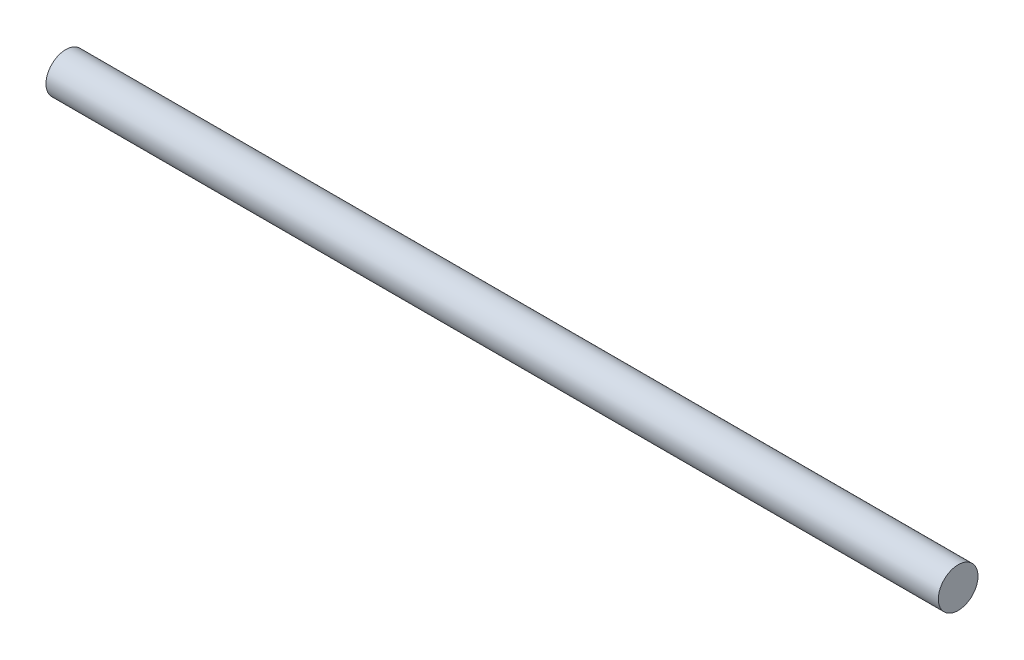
from build123d import *

# Parameters (mm, degrees)
SKETCH1_R           = 6
BOSS_EXTRUDE1_DEPTH = 270


with BuildPart() as part:
    # Sketch1 → Boss-Extrude1 (new body)
    with BuildSketch(Plane(origin=(0, 0, 0), x_dir=(0, 0, -1), z_dir=(1, 0, 0))):
        Circle(SKETCH1_R)
    extrude(amount=BOSS_EXTRUDE1_DEPTH)


solid = part.part
